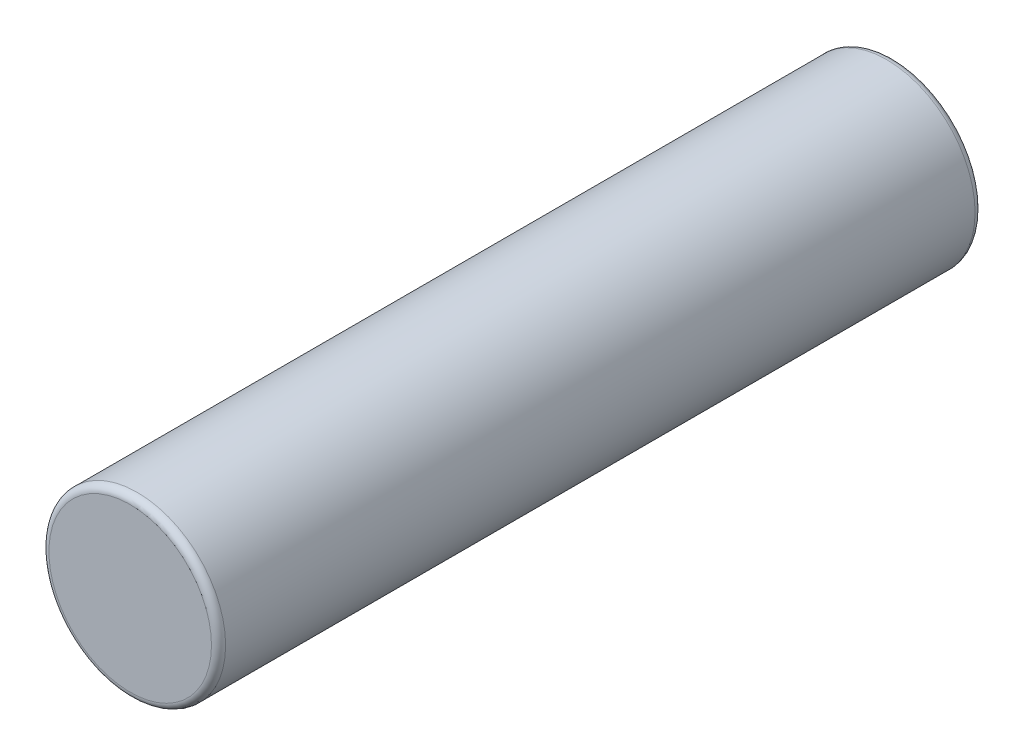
ISO-10303-21;
HEADER;
FILE_DESCRIPTION(('STEP AP214'),'2;1');
FILE_NAME('part.step','',(''),(''),'','','');
FILE_SCHEMA(('AUTOMOTIVE_DESIGN { 1 0 10303 214 1 1 1 1 }'));
ENDSEC;
DATA;
#1=APPLICATION_CONTEXT('core data for automotive mechanical design processes');
#2=APPLICATION_PROTOCOL_DEFINITION('international standard','automotive_design',2000,#1);
#3=PRODUCT_CONTEXT('',#1,'mechanical');
#4=PRODUCT('Part','Part','',(#3));
#5=PRODUCT_RELATED_PRODUCT_CATEGORY('part','',(#4));
#6=PRODUCT_DEFINITION_FORMATION('','',#4);
#7=PRODUCT_DEFINITION_CONTEXT('part definition',#1,'design');
#8=PRODUCT_DEFINITION('design','',#6,#7);
#9=PRODUCT_DEFINITION_SHAPE('','',#8);
#10=(LENGTH_UNIT() NAMED_UNIT(*) SI_UNIT(.MILLI.,.METRE.));
#11=(NAMED_UNIT(*) PLANE_ANGLE_UNIT() SI_UNIT($,.RADIAN.));
#12=(NAMED_UNIT(*) SI_UNIT($,.STERADIAN.) SOLID_ANGLE_UNIT());
#13=UNCERTAINTY_MEASURE_WITH_UNIT(LENGTH_MEASURE(1.E-05),#10,'distance_accuracy_value','');
#14=(GEOMETRIC_REPRESENTATION_CONTEXT(3) GLOBAL_UNCERTAINTY_ASSIGNED_CONTEXT((#13)) GLOBAL_UNIT_ASSIGNED_CONTEXT((#10,
#11,#12)) REPRESENTATION_CONTEXT('',''));
#15=CARTESIAN_POINT('',(0.,0.,0.));
#16=DIRECTION('',(0.,0.,1.));
#17=DIRECTION('',(1.,0.,0.));
#18=AXIS2_PLACEMENT_3D('',#15,#16,#17);
#19=CARTESIAN_POINT('',(0.,0.,108.));
#20=DIRECTION('',(0.,0.,-1.));
#21=DIRECTION('',(-1.,0.,0.));
#22=AXIS2_PLACEMENT_3D('',#19,#20,#21);
#23=CYLINDRICAL_SURFACE('',#22,12.495);
#24=CARTESIAN_POINT('',(0.,0.,1.));
#25=DIRECTION('',(0.,0.,1.));
#26=DIRECTION('',(1.,0.,0.));
#27=AXIS2_PLACEMENT_3D('',#24,#25,#26);
#28=CIRCLE('',#27,12.495);
#29=CARTESIAN_POINT('',(12.495,0.,1.));
#30=VERTEX_POINT('',#29);
#31=EDGE_CURVE('E41',#30,#30,#28,.T.);
#32=ORIENTED_EDGE('',*,*,#31,.T.);
#33=EDGE_LOOP('',(#32));
#34=FACE_BOUND('',#33,.T.);
#35=CARTESIAN_POINT('',(0.,0.,107.));
#36=DIRECTION('',(0.,0.,1.));
#37=DIRECTION('',(1.,0.,0.));
#38=AXIS2_PLACEMENT_3D('',#35,#36,#37);
#39=CIRCLE('',#38,12.495);
#40=CARTESIAN_POINT('',(12.495,0.,107.));
#41=VERTEX_POINT('',#40);
#42=EDGE_CURVE('E45',#41,#41,#39,.F.);
#43=ORIENTED_EDGE('',*,*,#42,.T.);
#44=EDGE_LOOP('',(#43));
#45=FACE_BOUND('',#44,.T.);
#46=ADVANCED_FACE('F30',(#34,#45),#23,.T.);
#47=CARTESIAN_POINT('',(0.,0.,108.));
#48=DIRECTION('',(0.,0.,1.));
#49=DIRECTION('',(1.,0.,0.));
#50=AXIS2_PLACEMENT_3D('',#47,#48,#49);
#51=PLANE('',#50);
#52=CARTESIAN_POINT('',(0.,0.,108.));
#53=DIRECTION('',(0.,0.,1.));
#54=DIRECTION('',(1.,0.,0.));
#55=AXIS2_PLACEMENT_3D('',#52,#53,#54);
#56=CIRCLE('',#55,11.495);
#57=CARTESIAN_POINT('',(11.495,0.,108.));
#58=VERTEX_POINT('',#57);
#59=EDGE_CURVE('E10',#58,#58,#56,.T.);
#60=ORIENTED_EDGE('',*,*,#59,.T.);
#61=EDGE_LOOP('',(#60));
#62=FACE_BOUND('',#61,.T.);
#63=ADVANCED_FACE('F61',(#62),#51,.T.);
#64=CARTESIAN_POINT('',(0.,0.,0.));
#65=DIRECTION('',(0.,0.,1.));
#66=DIRECTION('',(1.,0.,0.));
#67=AXIS2_PLACEMENT_3D('',#64,#65,#66);
#68=PLANE('',#67);
#69=CARTESIAN_POINT('',(0.,0.,0.));
#70=DIRECTION('',(0.,0.,1.));
#71=DIRECTION('',(1.,0.,0.));
#72=AXIS2_PLACEMENT_3D('',#69,#70,#71);
#73=CIRCLE('',#72,11.495);
#74=CARTESIAN_POINT('',(11.495,0.,0.));
#75=VERTEX_POINT('',#74);
#76=EDGE_CURVE('E37',#75,#75,#73,.F.);
#77=ORIENTED_EDGE('',*,*,#76,.T.);
#78=EDGE_LOOP('',(#77));
#79=FACE_BOUND('',#78,.T.);
#80=ADVANCED_FACE('F58',(#79),#68,.F.);
#81=CARTESIAN_POINT('',(0.,0.,1.));
#82=DIRECTION('',(0.,0.,1.));
#83=DIRECTION('',(1.,0.,0.));
#84=AXIS2_PLACEMENT_3D('',#81,#82,#83);
#85=TOROIDAL_SURFACE('',#84,11.495,1.);
#86=ORIENTED_EDGE('',*,*,#76,.F.);
#87=EDGE_LOOP('',(#86));
#88=FACE_BOUND('',#87,.T.);
#89=ORIENTED_EDGE('',*,*,#31,.F.);
#90=EDGE_LOOP('',(#89));
#91=FACE_BOUND('',#90,.T.);
#92=ADVANCED_FACE('F54',(#88,#91),#85,.T.);
#93=CARTESIAN_POINT('',(0.,0.,107.));
#94=DIRECTION('',(0.,0.,1.));
#95=DIRECTION('',(1.,0.,0.));
#96=AXIS2_PLACEMENT_3D('',#93,#94,#95);
#97=TOROIDAL_SURFACE('',#96,11.495,1.);
#98=ORIENTED_EDGE('',*,*,#42,.F.);
#99=EDGE_LOOP('',(#98));
#100=FACE_BOUND('',#99,.T.);
#101=ORIENTED_EDGE('',*,*,#59,.F.);
#102=EDGE_LOOP('',(#101));
#103=FACE_BOUND('',#102,.T.);
#104=ADVANCED_FACE('F32',(#100,#103),#97,.T.);
#105=CLOSED_SHELL('',(#46,#63,#80,#92,#104));
#106=MANIFOLD_SOLID_BREP('B2',#105);
#107=ADVANCED_BREP_SHAPE_REPRESENTATION('',(#18,#106),#14);
#108=SHAPE_DEFINITION_REPRESENTATION(#9,#107);
ENDSEC;
END-ISO-10303-21;
